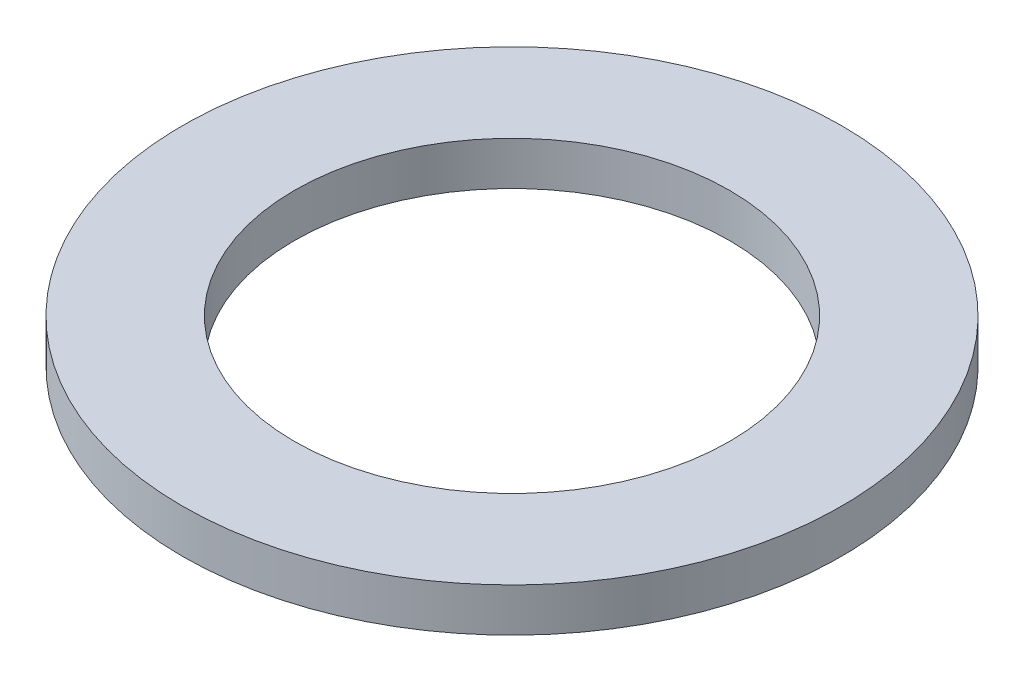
ISO-10303-21;
HEADER;
FILE_DESCRIPTION(('STEP AP214'),'2;1');
FILE_NAME('part.step','',(''),(''),'','','');
FILE_SCHEMA(('AUTOMOTIVE_DESIGN { 1 0 10303 214 1 1 1 1 }'));
ENDSEC;
DATA;
#1=APPLICATION_CONTEXT('core data for automotive mechanical design processes');
#2=APPLICATION_PROTOCOL_DEFINITION('international standard','automotive_design',2000,#1);
#3=PRODUCT_CONTEXT('',#1,'mechanical');
#4=PRODUCT('Part','Part','',(#3));
#5=PRODUCT_RELATED_PRODUCT_CATEGORY('part','',(#4));
#6=PRODUCT_DEFINITION_FORMATION('','',#4);
#7=PRODUCT_DEFINITION_CONTEXT('part definition',#1,'design');
#8=PRODUCT_DEFINITION('design','',#6,#7);
#9=PRODUCT_DEFINITION_SHAPE('','',#8);
#10=(LENGTH_UNIT() NAMED_UNIT(*) SI_UNIT(.MILLI.,.METRE.));
#11=(NAMED_UNIT(*) PLANE_ANGLE_UNIT() SI_UNIT($,.RADIAN.));
#12=(NAMED_UNIT(*) SI_UNIT($,.STERADIAN.) SOLID_ANGLE_UNIT());
#13=UNCERTAINTY_MEASURE_WITH_UNIT(LENGTH_MEASURE(1.E-05),#10,'distance_accuracy_value','');
#14=(GEOMETRIC_REPRESENTATION_CONTEXT(3) GLOBAL_UNCERTAINTY_ASSIGNED_CONTEXT((#13)) GLOBAL_UNIT_ASSIGNED_CONTEXT((#10,
#11,#12)) REPRESENTATION_CONTEXT('',''));
#15=CARTESIAN_POINT('',(0.,0.,0.));
#16=DIRECTION('',(0.,0.,1.));
#17=DIRECTION('',(1.,0.,0.));
#18=AXIS2_PLACEMENT_3D('',#15,#16,#17);
#19=CARTESIAN_POINT('',(0.,2.,0.));
#20=DIRECTION('',(0.,1.,0.));
#21=DIRECTION('',(0.,0.,1.));
#22=AXIS2_PLACEMENT_3D('',#19,#20,#21);
#23=PLANE('',#22);
#24=CARTESIAN_POINT('',(0.,2.,0.));
#25=DIRECTION('',(0.,1.,0.));
#26=DIRECTION('',(0.,0.,1.));
#27=AXIS2_PLACEMENT_3D('',#24,#25,#26);
#28=CIRCLE('',#27,15.15);
#29=CARTESIAN_POINT('',(0.,2.,15.15));
#30=VERTEX_POINT('',#29);
#31=EDGE_CURVE('E10',#30,#30,#28,.T.);
#32=ORIENTED_EDGE('',*,*,#31,.T.);
#33=EDGE_LOOP('',(#32));
#34=FACE_BOUND('',#33,.T.);
#35=CARTESIAN_POINT('',(0.,2.,0.));
#36=DIRECTION('',(0.,1.,0.));
#37=DIRECTION('',(0.,0.,1.));
#38=AXIS2_PLACEMENT_3D('',#35,#36,#37);
#39=CIRCLE('',#38,10.);
#40=CARTESIAN_POINT('',(0.,2.,10.));
#41=VERTEX_POINT('',#40);
#42=EDGE_CURVE('E42',#41,#41,#39,.T.);
#43=ORIENTED_EDGE('',*,*,#42,.F.);
#44=EDGE_LOOP('',(#43));
#45=FACE_BOUND('',#44,.T.);
#46=ADVANCED_FACE('F31',(#34,#45),#23,.T.);
#47=CARTESIAN_POINT('',(0.,0.,0.));
#48=DIRECTION('',(0.,1.,0.));
#49=DIRECTION('',(0.,0.,1.));
#50=AXIS2_PLACEMENT_3D('',#47,#48,#49);
#51=PLANE('',#50);
#52=CARTESIAN_POINT('',(0.,0.,0.));
#53=DIRECTION('',(0.,1.,0.));
#54=DIRECTION('',(0.,0.,1.));
#55=AXIS2_PLACEMENT_3D('',#52,#53,#54);
#56=CIRCLE('',#55,15.15);
#57=CARTESIAN_POINT('',(0.,0.,15.15));
#58=VERTEX_POINT('',#57);
#59=EDGE_CURVE('E35',#58,#58,#56,.T.);
#60=ORIENTED_EDGE('',*,*,#59,.F.);
#61=EDGE_LOOP('',(#60));
#62=FACE_BOUND('',#61,.T.);
#63=CARTESIAN_POINT('',(0.,0.,0.));
#64=DIRECTION('',(0.,1.,0.));
#65=DIRECTION('',(0.,0.,1.));
#66=AXIS2_PLACEMENT_3D('',#63,#64,#65);
#67=CIRCLE('',#66,10.);
#68=CARTESIAN_POINT('',(0.,0.,10.));
#69=VERTEX_POINT('',#68);
#70=EDGE_CURVE('E44',#69,#69,#67,.T.);
#71=ORIENTED_EDGE('',*,*,#70,.T.);
#72=EDGE_LOOP('',(#71));
#73=FACE_BOUND('',#72,.T.);
#74=ADVANCED_FACE('F54',(#62,#73),#51,.F.);
#75=CARTESIAN_POINT('',(0.,2.,0.));
#76=DIRECTION('',(0.,-1.,0.));
#77=DIRECTION('',(0.,0.,-1.));
#78=AXIS2_PLACEMENT_3D('',#75,#76,#77);
#79=CYLINDRICAL_SURFACE('',#78,15.15);
#80=ORIENTED_EDGE('',*,*,#31,.F.);
#81=EDGE_LOOP('',(#80));
#82=FACE_BOUND('',#81,.T.);
#83=ORIENTED_EDGE('',*,*,#59,.T.);
#84=EDGE_LOOP('',(#83));
#85=FACE_BOUND('',#84,.T.);
#86=ADVANCED_FACE('F33',(#82,#85),#79,.T.);
#87=CARTESIAN_POINT('',(0.,2.,0.));
#88=DIRECTION('',(0.,-1.,0.));
#89=DIRECTION('',(0.,0.,-1.));
#90=AXIS2_PLACEMENT_3D('',#87,#88,#89);
#91=CYLINDRICAL_SURFACE('',#90,10.);
#92=ORIENTED_EDGE('',*,*,#42,.T.);
#93=EDGE_LOOP('',(#92));
#94=FACE_BOUND('',#93,.T.);
#95=ORIENTED_EDGE('',*,*,#70,.F.);
#96=EDGE_LOOP('',(#95));
#97=FACE_BOUND('',#96,.T.);
#98=ADVANCED_FACE('F50',(#94,#97),#91,.F.);
#99=CLOSED_SHELL('',(#46,#74,#86,#98));
#100=MANIFOLD_SOLID_BREP('B2',#99);
#101=ADVANCED_BREP_SHAPE_REPRESENTATION('',(#18,#100),#14);
#102=SHAPE_DEFINITION_REPRESENTATION(#9,#101);
ENDSEC;
END-ISO-10303-21;
